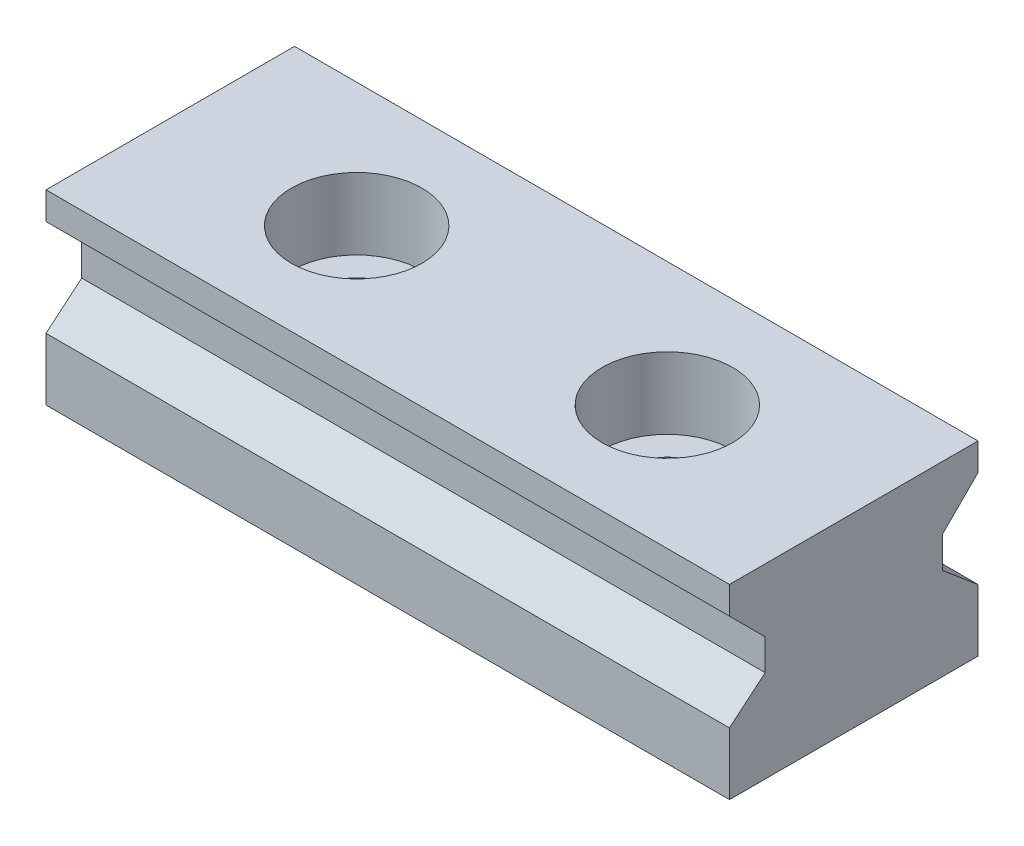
ISO-10303-21;
HEADER;
FILE_DESCRIPTION(('STEP AP214'),'2;1');
FILE_NAME('part.step','',(''),(''),'','','');
FILE_SCHEMA(('AUTOMOTIVE_DESIGN { 1 0 10303 214 1 1 1 1 }'));
ENDSEC;
DATA;
#1=APPLICATION_CONTEXT('core data for automotive mechanical design processes');
#2=APPLICATION_PROTOCOL_DEFINITION('international standard','automotive_design',2000,#1);
#3=PRODUCT_CONTEXT('',#1,'mechanical');
#4=PRODUCT('Part','Part','',(#3));
#5=PRODUCT_RELATED_PRODUCT_CATEGORY('part','',(#4));
#6=PRODUCT_DEFINITION_FORMATION('','',#4);
#7=PRODUCT_DEFINITION_CONTEXT('part definition',#1,'design');
#8=PRODUCT_DEFINITION('design','',#6,#7);
#9=PRODUCT_DEFINITION_SHAPE('','',#8);
#10=(LENGTH_UNIT() NAMED_UNIT(*) SI_UNIT(.MILLI.,.METRE.));
#11=(NAMED_UNIT(*) PLANE_ANGLE_UNIT() SI_UNIT($,.RADIAN.));
#12=(NAMED_UNIT(*) SI_UNIT($,.STERADIAN.) SOLID_ANGLE_UNIT());
#13=UNCERTAINTY_MEASURE_WITH_UNIT(LENGTH_MEASURE(1.E-05),#10,'distance_accuracy_value','');
#14=(GEOMETRIC_REPRESENTATION_CONTEXT(3) GLOBAL_UNCERTAINTY_ASSIGNED_CONTEXT((#13)) GLOBAL_UNIT_ASSIGNED_CONTEXT((#10,
#11,#12)) REPRESENTATION_CONTEXT('',''));
#15=CARTESIAN_POINT('',(0.,0.,0.));
#16=DIRECTION('',(0.,0.,1.));
#17=DIRECTION('',(1.,0.,0.));
#18=AXIS2_PLACEMENT_3D('',#15,#16,#17);
#19=CARTESIAN_POINT('',(-16.,5.114964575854,4.));
#20=DIRECTION('',(0.,-0.707106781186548,0.707106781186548));
#21=DIRECTION('',(0.,-0.707106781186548,-0.707106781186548));
#22=AXIS2_PLACEMENT_3D('',#19,#20,#21);
#23=PLANE('',#22);
#24=DIRECTION('',(1.,0.,0.));
#25=VECTOR('',#24,1.);
#26=CARTESIAN_POINT('',(-16.,5.114964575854,4.));
#27=LINE('',#26,#25);
#28=CARTESIAN_POINT('',(-16.,5.114964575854,4.));
#29=VERTEX_POINT('',#28);
#30=CARTESIAN_POINT('',(6.,5.114964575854,4.));
#31=VERTEX_POINT('',#30);
#32=EDGE_CURVE('E197',#29,#31,#27,.T.);
#33=ORIENTED_EDGE('',*,*,#32,.F.);
#34=DIRECTION('',(0.,-0.707106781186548,-0.707106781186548));
#35=VECTOR('',#34,1.);
#36=CARTESIAN_POINT('',(-16.,5.114964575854,4.));
#37=LINE('',#36,#35);
#38=CARTESIAN_POINT('',(-16.,3.964964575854,2.85));
#39=VERTEX_POINT('',#38);
#40=EDGE_CURVE('E117',#29,#39,#37,.T.);
#41=ORIENTED_EDGE('',*,*,#40,.T.);
#42=DIRECTION('',(1.,0.,0.));
#43=VECTOR('',#42,1.);
#44=CARTESIAN_POINT('',(-16.,3.964964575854,2.85));
#45=LINE('',#44,#43);
#46=CARTESIAN_POINT('',(6.,3.964964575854,2.85));
#47=VERTEX_POINT('',#46);
#48=EDGE_CURVE('E202',#47,#39,#45,.F.);
#49=ORIENTED_EDGE('',*,*,#48,.F.);
#50=DIRECTION('',(0.,-0.707106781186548,-0.707106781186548));
#51=VECTOR('',#50,1.);
#52=CARTESIAN_POINT('',(6.00000000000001,5.114964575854,4.));
#53=LINE('',#52,#51);
#54=EDGE_CURVE('E136',#47,#31,#53,.F.);
#55=ORIENTED_EDGE('',*,*,#54,.T.);
#56=EDGE_LOOP('',(#33,#41,#49,#55));
#57=FACE_BOUND('',#56,.T.);
#58=ADVANCED_FACE('F16',(#57),#23,.T.);
#59=CARTESIAN_POINT('',(-16.,3.964964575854,-2.85));
#60=DIRECTION('',(0.,-0.707106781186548,-0.707106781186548));
#61=DIRECTION('',(0.,0.707106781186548,-0.707106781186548));
#62=AXIS2_PLACEMENT_3D('',#59,#60,#61);
#63=PLANE('',#62);
#64=DIRECTION('',(-1.,0.,0.));
#65=VECTOR('',#64,1.);
#66=CARTESIAN_POINT('',(-16.,3.964964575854,-2.85));
#67=LINE('',#66,#65);
#68=CARTESIAN_POINT('',(-16.,3.964964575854,-2.85));
#69=VERTEX_POINT('',#68);
#70=CARTESIAN_POINT('',(6.,3.964964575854,-2.85));
#71=VERTEX_POINT('',#70);
#72=EDGE_CURVE('E111',#69,#71,#67,.F.);
#73=ORIENTED_EDGE('',*,*,#72,.F.);
#74=DIRECTION('',(0.,0.707106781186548,-0.707106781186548));
#75=VECTOR('',#74,1.);
#76=CARTESIAN_POINT('',(-16.,3.964964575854,-2.85));
#77=LINE('',#76,#75);
#78=CARTESIAN_POINT('',(-16.,5.114964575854,-4.));
#79=VERTEX_POINT('',#78);
#80=EDGE_CURVE('E102',#69,#79,#77,.T.);
#81=ORIENTED_EDGE('',*,*,#80,.T.);
#82=DIRECTION('',(-1.,0.,0.));
#83=VECTOR('',#82,1.);
#84=CARTESIAN_POINT('',(-16.,5.114964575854,-4.));
#85=LINE('',#84,#83);
#86=CARTESIAN_POINT('',(6.,5.114964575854,-4.));
#87=VERTEX_POINT('',#86);
#88=EDGE_CURVE('E114',#87,#79,#85,.T.);
#89=ORIENTED_EDGE('',*,*,#88,.F.);
#90=DIRECTION('',(0.,0.707106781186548,-0.707106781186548));
#91=VECTOR('',#90,1.);
#92=CARTESIAN_POINT('',(6.00000000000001,3.964964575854,-2.85));
#93=LINE('',#92,#91);
#94=EDGE_CURVE('E107',#87,#71,#93,.F.);
#95=ORIENTED_EDGE('',*,*,#94,.T.);
#96=EDGE_LOOP('',(#73,#81,#89,#95));
#97=FACE_BOUND('',#96,.T.);
#98=ADVANCED_FACE('F109',(#97),#63,.T.);
#99=CARTESIAN_POINT('',(-16.,2.964964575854,-2.85));
#100=DIRECTION('',(0.,0.,-1.));
#101=DIRECTION('',(-1.,0.,0.));
#102=AXIS2_PLACEMENT_3D('',#99,#100,#101);
#103=PLANE('',#102);
#104=DIRECTION('',(1.,0.,0.));
#105=VECTOR('',#104,1.);
#106=CARTESIAN_POINT('',(-16.,2.96496457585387,-2.84999999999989));
#107=LINE('',#106,#105);
#108=CARTESIAN_POINT('',(-16.,2.96496457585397,-2.84999999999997));
#109=VERTEX_POINT('',#108);
#110=CARTESIAN_POINT('',(6.,2.96496457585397,-2.84999999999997));
#111=VERTEX_POINT('',#110);
#112=EDGE_CURVE('E185',#109,#111,#107,.T.);
#113=ORIENTED_EDGE('',*,*,#112,.F.);
#114=DIRECTION('',(0.,1.,0.));
#115=VECTOR('',#114,1.);
#116=CARTESIAN_POINT('',(-16.,2.964964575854,-2.85));
#117=LINE('',#116,#115);
#118=EDGE_CURVE('E128',#109,#69,#117,.T.);
#119=ORIENTED_EDGE('',*,*,#118,.T.);
#120=ORIENTED_EDGE('',*,*,#72,.T.);
#121=DIRECTION('',(0.,1.,0.));
#122=VECTOR('',#121,1.);
#123=CARTESIAN_POINT('',(6.,2.964964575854,-2.85));
#124=LINE('',#123,#122);
#125=EDGE_CURVE('E120',#71,#111,#124,.F.);
#126=ORIENTED_EDGE('',*,*,#125,.T.);
#127=EDGE_LOOP('',(#113,#119,#120,#126));
#128=FACE_BOUND('',#127,.T.);
#129=ADVANCED_FACE('F130',(#128),#103,.T.);
#130=CARTESIAN_POINT('',(-16.,3.964964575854,2.85));
#131=DIRECTION('',(0.,0.,1.));
#132=DIRECTION('',(1.,0.,0.));
#133=AXIS2_PLACEMENT_3D('',#130,#131,#132);
#134=PLANE('',#133);
#135=ORIENTED_EDGE('',*,*,#48,.T.);
#136=DIRECTION('',(0.,1.,0.));
#137=VECTOR('',#136,1.);
#138=CARTESIAN_POINT('',(-16.,3.964964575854,2.85));
#139=LINE('',#138,#137);
#140=CARTESIAN_POINT('',(-16.,2.964964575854,2.85));
#141=VERTEX_POINT('',#140);
#142=EDGE_CURVE('E200',#39,#141,#139,.F.);
#143=ORIENTED_EDGE('',*,*,#142,.T.);
#144=DIRECTION('',(1.,0.,0.));
#145=VECTOR('',#144,1.);
#146=CARTESIAN_POINT('',(-16.,2.964964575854,2.85));
#147=LINE('',#146,#145);
#148=CARTESIAN_POINT('',(6.,2.964964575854,2.85));
#149=VERTEX_POINT('',#148);
#150=EDGE_CURVE('E178',#149,#141,#147,.F.);
#151=ORIENTED_EDGE('',*,*,#150,.F.);
#152=DIRECTION('',(0.,1.,0.));
#153=VECTOR('',#152,1.);
#154=CARTESIAN_POINT('',(6.,3.964964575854,2.85));
#155=LINE('',#154,#153);
#156=EDGE_CURVE('E205',#149,#47,#155,.T.);
#157=ORIENTED_EDGE('',*,*,#156,.T.);
#158=EDGE_LOOP('',(#135,#143,#151,#157));
#159=FACE_BOUND('',#158,.T.);
#160=ADVANCED_FACE('F209',(#159),#134,.T.);
#161=CARTESIAN_POINT('',(-16.,6.,4.));
#162=DIRECTION('',(0.,0.,1.));
#163=DIRECTION('',(1.,0.,0.));
#164=AXIS2_PLACEMENT_3D('',#161,#162,#163);
#165=PLANE('',#164);
#166=DIRECTION('',(1.,0.,0.));
#167=VECTOR('',#166,1.);
#168=CARTESIAN_POINT('',(-16.,6.,4.));
#169=LINE('',#168,#167);
#170=CARTESIAN_POINT('',(-16.,6.,4.));
#171=VERTEX_POINT('',#170);
#172=CARTESIAN_POINT('',(6.,6.,4.));
#173=VERTEX_POINT('',#172);
#174=EDGE_CURVE('E164',#171,#173,#169,.T.);
#175=ORIENTED_EDGE('',*,*,#174,.F.);
#176=DIRECTION('',(0.,1.,0.));
#177=VECTOR('',#176,1.);
#178=CARTESIAN_POINT('',(-16.,6.,4.));
#179=LINE('',#178,#177);
#180=EDGE_CURVE('E192',#171,#29,#179,.F.);
#181=ORIENTED_EDGE('',*,*,#180,.T.);
#182=ORIENTED_EDGE('',*,*,#32,.T.);
#183=DIRECTION('',(0.,1.,0.));
#184=VECTOR('',#183,1.);
#185=CARTESIAN_POINT('',(6.,6.,4.));
#186=LINE('',#185,#184);
#187=EDGE_CURVE('E195',#31,#173,#186,.T.);
#188=ORIENTED_EDGE('',*,*,#187,.T.);
#189=EDGE_LOOP('',(#175,#181,#182,#188));
#190=FACE_BOUND('',#189,.T.);
#191=ADVANCED_FACE('F305',(#190),#165,.T.);
#192=CARTESIAN_POINT('',(-16.,5.114964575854,-4.));
#193=DIRECTION('',(0.,0.,-1.));
#194=DIRECTION('',(-1.,0.,0.));
#195=AXIS2_PLACEMENT_3D('',#192,#193,#194);
#196=PLANE('',#195);
#197=ORIENTED_EDGE('',*,*,#88,.T.);
#198=DIRECTION('',(0.,1.,0.));
#199=VECTOR('',#198,1.);
#200=CARTESIAN_POINT('',(-16.,5.114964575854,-4.));
#201=LINE('',#200,#199);
#202=CARTESIAN_POINT('',(-16.,6.,-4.));
#203=VERTEX_POINT('',#202);
#204=EDGE_CURVE('E187',#79,#203,#201,.T.);
#205=ORIENTED_EDGE('',*,*,#204,.T.);
#206=DIRECTION('',(1.,0.,0.));
#207=VECTOR('',#206,1.);
#208=CARTESIAN_POINT('',(-16.,6.,-4.));
#209=LINE('',#208,#207);
#210=CARTESIAN_POINT('',(6.,6.,-4.));
#211=VERTEX_POINT('',#210);
#212=EDGE_CURVE('E160',#211,#203,#209,.F.);
#213=ORIENTED_EDGE('',*,*,#212,.F.);
#214=DIRECTION('',(0.,1.,0.));
#215=VECTOR('',#214,1.);
#216=CARTESIAN_POINT('',(6.,5.114964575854,-4.));
#217=LINE('',#216,#215);
#218=EDGE_CURVE('E190',#211,#87,#217,.F.);
#219=ORIENTED_EDGE('',*,*,#218,.T.);
#220=EDGE_LOOP('',(#197,#205,#213,#219));
#221=FACE_BOUND('',#220,.T.);
#222=ADVANCED_FACE('F296',(#221),#196,.T.);
#223=CARTESIAN_POINT('',(0.,-0.3,0.));
#224=DIRECTION('',(0.,1.,0.));
#225=DIRECTION('',(0.,0.,1.));
#226=AXIS2_PLACEMENT_3D('',#223,#224,#225);
#227=CYLINDRICAL_SURFACE('',#226,2.1);
#228=CARTESIAN_POINT('',(0.,3.7,0.));
#229=DIRECTION('',(0.,1.,0.));
#230=DIRECTION('',(0.,0.,1.));
#231=AXIS2_PLACEMENT_3D('',#228,#229,#230);
#232=CIRCLE('',#231,2.1);
#233=CARTESIAN_POINT('',(0.,3.7,2.1));
#234=VERTEX_POINT('',#233);
#235=EDGE_CURVE('E153',#234,#234,#232,.T.);
#236=ORIENTED_EDGE('',*,*,#235,.F.);
#237=EDGE_LOOP('',(#236));
#238=FACE_BOUND('',#237,.T.);
#239=CARTESIAN_POINT('',(0.,6.,0.));
#240=DIRECTION('',(0.,1.,0.));
#241=DIRECTION('',(0.,0.,1.));
#242=AXIS2_PLACEMENT_3D('',#239,#240,#241);
#243=CIRCLE('',#242,2.1);
#244=CARTESIAN_POINT('',(0.,6.,2.1));
#245=VERTEX_POINT('',#244);
#246=EDGE_CURVE('E19',#245,#245,#243,.F.);
#247=ORIENTED_EDGE('',*,*,#246,.F.);
#248=EDGE_LOOP('',(#247));
#249=FACE_BOUND('',#248,.T.);
#250=ADVANCED_FACE('F292',(#238,#249),#227,.F.);
#251=CARTESIAN_POINT('',(-10.,-0.3,0.));
#252=DIRECTION('',(0.,1.,0.));
#253=DIRECTION('',(0.,0.,1.));
#254=AXIS2_PLACEMENT_3D('',#251,#252,#253);
#255=CYLINDRICAL_SURFACE('',#254,2.1);
#256=CARTESIAN_POINT('',(-10.,3.7,0.));
#257=DIRECTION('',(0.,1.,0.));
#258=DIRECTION('',(0.,0.,1.));
#259=AXIS2_PLACEMENT_3D('',#256,#257,#258);
#260=CIRCLE('',#259,2.1);
#261=CARTESIAN_POINT('',(-10.,3.7,2.1));
#262=VERTEX_POINT('',#261);
#263=EDGE_CURVE('E149',#262,#262,#260,.T.);
#264=ORIENTED_EDGE('',*,*,#263,.F.);
#265=EDGE_LOOP('',(#264));
#266=FACE_BOUND('',#265,.T.);
#267=CARTESIAN_POINT('',(-10.,6.,0.));
#268=DIRECTION('',(0.,1.,0.));
#269=DIRECTION('',(0.,0.,1.));
#270=AXIS2_PLACEMENT_3D('',#267,#268,#269);
#271=CIRCLE('',#270,2.1);
#272=CARTESIAN_POINT('',(-10.,6.,2.1));
#273=VERTEX_POINT('',#272);
#274=EDGE_CURVE('E155',#273,#273,#271,.F.);
#275=ORIENTED_EDGE('',*,*,#274,.F.);
#276=EDGE_LOOP('',(#275));
#277=FACE_BOUND('',#276,.T.);
#278=ADVANCED_FACE('F295',(#266,#277),#255,.F.);
#279=CARTESIAN_POINT('',(-16.,2.,-4.));
#280=DIRECTION('',(0.,0.766044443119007,-0.642787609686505));
#281=DIRECTION('',(0.,0.642787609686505,0.766044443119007));
#282=AXIS2_PLACEMENT_3D('',#279,#280,#281);
#283=PLANE('',#282);
#284=DIRECTION('',(-1.,0.,0.));
#285=VECTOR('',#284,1.);
#286=CARTESIAN_POINT('',(-16.,2.,-4.));
#287=LINE('',#286,#285);
#288=CARTESIAN_POINT('',(-16.,2.,-4.));
#289=VERTEX_POINT('',#288);
#290=CARTESIAN_POINT('',(6.,2.,-4.));
#291=VERTEX_POINT('',#290);
#292=EDGE_CURVE('E152',#289,#291,#287,.F.);
#293=ORIENTED_EDGE('',*,*,#292,.F.);
#294=DIRECTION('',(0.,0.642787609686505,0.766044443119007));
#295=VECTOR('',#294,1.);
#296=CARTESIAN_POINT('',(-16.,2.,-4.));
#297=LINE('',#296,#295);
#298=EDGE_CURVE('E181',#289,#109,#297,.T.);
#299=ORIENTED_EDGE('',*,*,#298,.T.);
#300=ORIENTED_EDGE('',*,*,#112,.T.);
#301=DIRECTION('',(0.,0.642787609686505,0.766044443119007));
#302=VECTOR('',#301,1.);
#303=CARTESIAN_POINT('',(6.,2.,-4.));
#304=LINE('',#303,#302);
#305=EDGE_CURVE('E124',#111,#291,#304,.F.);
#306=ORIENTED_EDGE('',*,*,#305,.T.);
#307=EDGE_LOOP('',(#293,#299,#300,#306));
#308=FACE_BOUND('',#307,.T.);
#309=ADVANCED_FACE('F302',(#308),#283,.T.);
#310=CARTESIAN_POINT('',(-16.,2.964964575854,2.85));
#311=DIRECTION('',(0.,0.766044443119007,0.642787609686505));
#312=DIRECTION('',(0.,-0.642787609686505,0.766044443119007));
#313=AXIS2_PLACEMENT_3D('',#310,#311,#312);
#314=PLANE('',#313);
#315=ORIENTED_EDGE('',*,*,#150,.T.);
#316=DIRECTION('',(0.,-0.642787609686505,0.766044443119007));
#317=VECTOR('',#316,1.);
#318=CARTESIAN_POINT('',(-16.,2.964964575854,2.85));
#319=LINE('',#318,#317);
#320=CARTESIAN_POINT('',(-16.,2.00000000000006,4.00000000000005));
#321=VERTEX_POINT('',#320);
#322=EDGE_CURVE('E172',#141,#321,#319,.T.);
#323=ORIENTED_EDGE('',*,*,#322,.T.);
#324=DIRECTION('',(1.,0.,0.));
#325=VECTOR('',#324,1.);
#326=CARTESIAN_POINT('',(-16.,2.,4.));
#327=LINE('',#326,#325);
#328=CARTESIAN_POINT('',(6.,2.00000000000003,4.00000000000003));
#329=VERTEX_POINT('',#328);
#330=EDGE_CURVE('E222',#329,#321,#327,.F.);
#331=ORIENTED_EDGE('',*,*,#330,.F.);
#332=DIRECTION('',(0.,-0.64278760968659,0.766044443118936));
#333=VECTOR('',#332,1.);
#334=CARTESIAN_POINT('',(6.,2.964964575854,2.85));
#335=LINE('',#334,#333);
#336=EDGE_CURVE('E212',#149,#329,#335,.T.);
#337=ORIENTED_EDGE('',*,*,#336,.F.);
#338=EDGE_LOOP('',(#315,#323,#331,#337));
#339=FACE_BOUND('',#338,.T.);
#340=ADVANCED_FACE('F221',(#339),#314,.T.);
#341=CARTESIAN_POINT('',(-16.,6.,-4.));
#342=DIRECTION('',(0.,1.,0.));
#343=DIRECTION('',(0.,0.,1.));
#344=AXIS2_PLACEMENT_3D('',#341,#342,#343);
#345=PLANE('',#344);
#346=ORIENTED_EDGE('',*,*,#274,.T.);
#347=EDGE_LOOP('',(#346));
#348=FACE_BOUND('',#347,.T.);
#349=ORIENTED_EDGE('',*,*,#246,.T.);
#350=EDGE_LOOP('',(#349));
#351=FACE_BOUND('',#350,.T.);
#352=ORIENTED_EDGE('',*,*,#212,.T.);
#353=DIRECTION('',(0.,0.,-1.));
#354=VECTOR('',#353,1.);
#355=CARTESIAN_POINT('',(-16.,6.,0.));
#356=LINE('',#355,#354);
#357=EDGE_CURVE('E148',#203,#171,#356,.F.);
#358=ORIENTED_EDGE('',*,*,#357,.T.);
#359=ORIENTED_EDGE('',*,*,#174,.T.);
#360=DIRECTION('',(0.,0.,-1.));
#361=VECTOR('',#360,1.);
#362=CARTESIAN_POINT('',(6.,6.,0.));
#363=LINE('',#362,#361);
#364=EDGE_CURVE('E225',#211,#173,#363,.F.);
#365=ORIENTED_EDGE('',*,*,#364,.F.);
#366=EDGE_LOOP('',(#352,#358,#359,#365));
#367=FACE_BOUND('',#366,.T.);
#368=ADVANCED_FACE('F288',(#348,#351,#367),#345,.T.);
#369=CARTESIAN_POINT('',(0.,3.7,0.));
#370=DIRECTION('',(0.,1.,0.));
#371=DIRECTION('',(0.,0.,1.));
#372=AXIS2_PLACEMENT_3D('',#369,#370,#371);
#373=PLANE('',#372);
#374=CARTESIAN_POINT('',(0.,3.7,0.));
#375=DIRECTION('',(0.,1.,0.));
#376=DIRECTION('',(0.,0.,1.));
#377=AXIS2_PLACEMENT_3D('',#374,#375,#376);
#378=CIRCLE('',#377,1.2);
#379=CARTESIAN_POINT('',(0.,3.7,1.2));
#380=VERTEX_POINT('',#379);
#381=EDGE_CURVE('E145',#380,#380,#378,.F.);
#382=ORIENTED_EDGE('',*,*,#381,.T.);
#383=EDGE_LOOP('',(#382));
#384=FACE_BOUND('',#383,.T.);
#385=ORIENTED_EDGE('',*,*,#235,.T.);
#386=EDGE_LOOP('',(#385));
#387=FACE_BOUND('',#386,.T.);
#388=ADVANCED_FACE('F284',(#384,#387),#373,.T.);
#389=CARTESIAN_POINT('',(-10.,3.7,0.));
#390=DIRECTION('',(0.,1.,0.));
#391=DIRECTION('',(0.,0.,1.));
#392=AXIS2_PLACEMENT_3D('',#389,#390,#391);
#393=PLANE('',#392);
#394=CARTESIAN_POINT('',(-10.,3.7,0.));
#395=DIRECTION('',(0.,1.,0.));
#396=DIRECTION('',(0.,0.,1.));
#397=AXIS2_PLACEMENT_3D('',#394,#395,#396);
#398=CIRCLE('',#397,1.2);
#399=CARTESIAN_POINT('',(-10.,3.7,1.2));
#400=VERTEX_POINT('',#399);
#401=EDGE_CURVE('E141',#400,#400,#398,.F.);
#402=ORIENTED_EDGE('',*,*,#401,.T.);
#403=EDGE_LOOP('',(#402));
#404=FACE_BOUND('',#403,.T.);
#405=ORIENTED_EDGE('',*,*,#263,.T.);
#406=EDGE_LOOP('',(#405));
#407=FACE_BOUND('',#406,.T.);
#408=ADVANCED_FACE('F287',(#404,#407),#393,.T.);
#409=CARTESIAN_POINT('',(-16.,0.,-4.));
#410=DIRECTION('',(0.,0.,-1.));
#411=DIRECTION('',(-1.,0.,0.));
#412=AXIS2_PLACEMENT_3D('',#409,#410,#411);
#413=PLANE('',#412);
#414=DIRECTION('',(1.,0.,0.));
#415=VECTOR('',#414,1.);
#416=CARTESIAN_POINT('',(-16.,0.,-4.));
#417=LINE('',#416,#415);
#418=CARTESIAN_POINT('',(-16.,0.,-4.));
#419=VERTEX_POINT('',#418);
#420=CARTESIAN_POINT('',(6.,0.,-4.));
#421=VERTEX_POINT('',#420);
#422=EDGE_CURVE('E144',#419,#421,#417,.T.);
#423=ORIENTED_EDGE('',*,*,#422,.F.);
#424=DIRECTION('',(0.,1.,0.));
#425=VECTOR('',#424,1.);
#426=CARTESIAN_POINT('',(-16.,0.,-4.));
#427=LINE('',#426,#425);
#428=EDGE_CURVE('E234',#419,#289,#427,.T.);
#429=ORIENTED_EDGE('',*,*,#428,.T.);
#430=ORIENTED_EDGE('',*,*,#292,.T.);
#431=DIRECTION('',(0.,1.,0.));
#432=VECTOR('',#431,1.);
#433=CARTESIAN_POINT('',(6.,0.,-4.));
#434=LINE('',#433,#432);
#435=EDGE_CURVE('E224',#421,#291,#434,.T.);
#436=ORIENTED_EDGE('',*,*,#435,.F.);
#437=EDGE_LOOP('',(#423,#429,#430,#436));
#438=FACE_BOUND('',#437,.T.);
#439=ADVANCED_FACE('F252',(#438),#413,.T.);
#440=CARTESIAN_POINT('',(6.,0.,0.));
#441=DIRECTION('',(1.,0.,0.));
#442=DIRECTION('',(0.,0.,-1.));
#443=AXIS2_PLACEMENT_3D('',#440,#441,#442);
#444=PLANE('',#443);
#445=ORIENTED_EDGE('',*,*,#364,.T.);
#446=ORIENTED_EDGE('',*,*,#187,.F.);
#447=ORIENTED_EDGE('',*,*,#54,.F.);
#448=ORIENTED_EDGE('',*,*,#156,.F.);
#449=ORIENTED_EDGE('',*,*,#336,.T.);
#450=DIRECTION('',(0.,1.,0.));
#451=VECTOR('',#450,1.);
#452=CARTESIAN_POINT('',(6.,2.,4.));
#453=LINE('',#452,#451);
#454=CARTESIAN_POINT('',(6.,0.,4.));
#455=VERTEX_POINT('',#454);
#456=EDGE_CURVE('E230',#455,#329,#453,.T.);
#457=ORIENTED_EDGE('',*,*,#456,.F.);
#458=DIRECTION('',(0.,0.,-1.));
#459=VECTOR('',#458,1.);
#460=CARTESIAN_POINT('',(6.,0.,4.));
#461=LINE('',#460,#459);
#462=EDGE_CURVE('E240',#421,#455,#461,.F.);
#463=ORIENTED_EDGE('',*,*,#462,.F.);
#464=ORIENTED_EDGE('',*,*,#435,.T.);
#465=ORIENTED_EDGE('',*,*,#305,.F.);
#466=ORIENTED_EDGE('',*,*,#125,.F.);
#467=ORIENTED_EDGE('',*,*,#94,.F.);
#468=ORIENTED_EDGE('',*,*,#218,.F.);
#469=EDGE_LOOP('',(#445,#446,#447,#448,#449,#457,#463,#464,#465,#466,#467,#468));
#470=FACE_BOUND('',#469,.T.);
#471=ADVANCED_FACE('F122',(#470),#444,.T.);
#472=CARTESIAN_POINT('',(-16.,2.,4.));
#473=DIRECTION('',(0.,0.,1.));
#474=DIRECTION('',(1.,0.,0.));
#475=AXIS2_PLACEMENT_3D('',#472,#473,#474);
#476=PLANE('',#475);
#477=ORIENTED_EDGE('',*,*,#330,.T.);
#478=DIRECTION('',(0.,1.,0.));
#479=VECTOR('',#478,1.);
#480=CARTESIAN_POINT('',(-16.,0.,4.));
#481=LINE('',#480,#479);
#482=CARTESIAN_POINT('',(-16.,0.,4.));
#483=VERTEX_POINT('',#482);
#484=EDGE_CURVE('E34',#321,#483,#481,.F.);
#485=ORIENTED_EDGE('',*,*,#484,.T.);
#486=DIRECTION('',(1.,0.,0.));
#487=VECTOR('',#486,1.);
#488=CARTESIAN_POINT('',(-16.,0.,4.));
#489=LINE('',#488,#487);
#490=EDGE_CURVE('E243',#455,#483,#489,.F.);
#491=ORIENTED_EDGE('',*,*,#490,.F.);
#492=ORIENTED_EDGE('',*,*,#456,.T.);
#493=EDGE_LOOP('',(#477,#485,#491,#492));
#494=FACE_BOUND('',#493,.T.);
#495=ADVANCED_FACE('F254',(#494),#476,.T.);
#496=CARTESIAN_POINT('',(-16.,0.,0.));
#497=DIRECTION('',(1.,0.,0.));
#498=DIRECTION('',(0.,0.,-1.));
#499=AXIS2_PLACEMENT_3D('',#496,#497,#498);
#500=PLANE('',#499);
#501=ORIENTED_EDGE('',*,*,#204,.F.);
#502=ORIENTED_EDGE('',*,*,#80,.F.);
#503=ORIENTED_EDGE('',*,*,#118,.F.);
#504=ORIENTED_EDGE('',*,*,#298,.F.);
#505=ORIENTED_EDGE('',*,*,#428,.F.);
#506=DIRECTION('',(0.,0.,-1.));
#507=VECTOR('',#506,1.);
#508=CARTESIAN_POINT('',(-16.,0.,4.));
#509=LINE('',#508,#507);
#510=EDGE_CURVE('E140',#483,#419,#509,.T.);
#511=ORIENTED_EDGE('',*,*,#510,.F.);
#512=ORIENTED_EDGE('',*,*,#484,.F.);
#513=ORIENTED_EDGE('',*,*,#322,.F.);
#514=ORIENTED_EDGE('',*,*,#142,.F.);
#515=ORIENTED_EDGE('',*,*,#40,.F.);
#516=ORIENTED_EDGE('',*,*,#180,.F.);
#517=ORIENTED_EDGE('',*,*,#357,.F.);
#518=EDGE_LOOP('',(#501,#502,#503,#504,#505,#511,#512,#513,#514,#515,#516,#517));
#519=FACE_BOUND('',#518,.T.);
#520=ADVANCED_FACE('F219',(#519),#500,.F.);
#521=CARTESIAN_POINT('',(0.,-0.3,0.));
#522=DIRECTION('',(0.,1.,0.));
#523=DIRECTION('',(0.,0.,1.));
#524=AXIS2_PLACEMENT_3D('',#521,#522,#523);
#525=CYLINDRICAL_SURFACE('',#524,1.2);
#526=ORIENTED_EDGE('',*,*,#381,.F.);
#527=EDGE_LOOP('',(#526));
#528=FACE_BOUND('',#527,.T.);
#529=CARTESIAN_POINT('',(0.,0.,0.));
#530=DIRECTION('',(0.,1.,0.));
#531=DIRECTION('',(0.,0.,1.));
#532=AXIS2_PLACEMENT_3D('',#529,#530,#531);
#533=CIRCLE('',#532,1.2);
#534=CARTESIAN_POINT('',(0.,0.,1.2));
#535=VERTEX_POINT('',#534);
#536=EDGE_CURVE('E25',#535,#535,#533,.T.);
#537=ORIENTED_EDGE('',*,*,#536,.F.);
#538=EDGE_LOOP('',(#537));
#539=FACE_BOUND('',#538,.T.);
#540=ADVANCED_FACE('F262',(#528,#539),#525,.F.);
#541=CARTESIAN_POINT('',(-10.,-0.3,0.));
#542=DIRECTION('',(0.,1.,0.));
#543=DIRECTION('',(0.,0.,1.));
#544=AXIS2_PLACEMENT_3D('',#541,#542,#543);
#545=CYLINDRICAL_SURFACE('',#544,1.2);
#546=ORIENTED_EDGE('',*,*,#401,.F.);
#547=EDGE_LOOP('',(#546));
#548=FACE_BOUND('',#547,.T.);
#549=CARTESIAN_POINT('',(-10.,0.,0.));
#550=DIRECTION('',(0.,1.,0.));
#551=DIRECTION('',(0.,0.,1.));
#552=AXIS2_PLACEMENT_3D('',#549,#550,#551);
#553=CIRCLE('',#552,1.2);
#554=CARTESIAN_POINT('',(-10.,0.,1.2));
#555=VERTEX_POINT('',#554);
#556=EDGE_CURVE('E11',#555,#555,#553,.T.);
#557=ORIENTED_EDGE('',*,*,#556,.F.);
#558=EDGE_LOOP('',(#557));
#559=FACE_BOUND('',#558,.T.);
#560=ADVANCED_FACE('F266',(#548,#559),#545,.F.);
#561=CARTESIAN_POINT('',(-16.,0.,4.));
#562=DIRECTION('',(0.,-1.,0.));
#563=DIRECTION('',(0.,0.,-1.));
#564=AXIS2_PLACEMENT_3D('',#561,#562,#563);
#565=PLANE('',#564);
#566=ORIENTED_EDGE('',*,*,#556,.T.);
#567=EDGE_LOOP('',(#566));
#568=FACE_BOUND('',#567,.T.);
#569=ORIENTED_EDGE('',*,*,#536,.T.);
#570=EDGE_LOOP('',(#569));
#571=FACE_BOUND('',#570,.T.);
#572=ORIENTED_EDGE('',*,*,#490,.T.);
#573=ORIENTED_EDGE('',*,*,#510,.T.);
#574=ORIENTED_EDGE('',*,*,#422,.T.);
#575=ORIENTED_EDGE('',*,*,#462,.T.);
#576=EDGE_LOOP('',(#572,#573,#574,#575));
#577=FACE_BOUND('',#576,.T.);
#578=ADVANCED_FACE('F248',(#568,#571,#577),#565,.T.);
#579=CLOSED_SHELL('',(#58,#98,#129,#160,#191,#222,#250,#278,#309,#340,#368,#388,#408,#439,#471,
#495,#520,#540,#560,#578));
#580=MANIFOLD_SOLID_BREP('B1',#579);
#581=ADVANCED_BREP_SHAPE_REPRESENTATION('',(#18,#580),#14);
#582=SHAPE_DEFINITION_REPRESENTATION(#9,#581);
ENDSEC;
END-ISO-10303-21;
